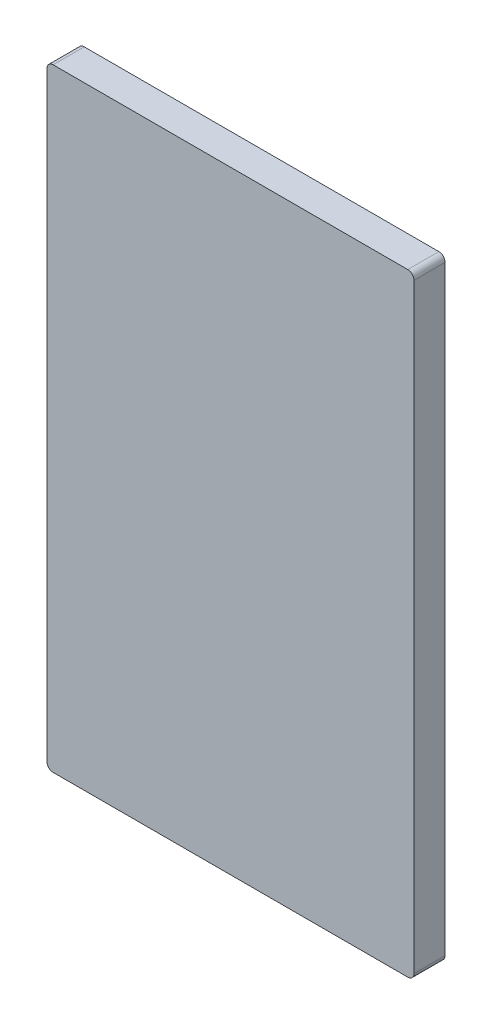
ISO-10303-21;
HEADER;
FILE_DESCRIPTION(('STEP AP214'),'2;1');
FILE_NAME('part.step','',(''),(''),'','','');
FILE_SCHEMA(('AUTOMOTIVE_DESIGN { 1 0 10303 214 1 1 1 1 }'));
ENDSEC;
DATA;
#1=APPLICATION_CONTEXT('core data for automotive mechanical design processes');
#2=APPLICATION_PROTOCOL_DEFINITION('international standard','automotive_design',2000,#1);
#3=PRODUCT_CONTEXT('',#1,'mechanical');
#4=PRODUCT('Part','Part','',(#3));
#5=PRODUCT_RELATED_PRODUCT_CATEGORY('part','',(#4));
#6=PRODUCT_DEFINITION_FORMATION('','',#4);
#7=PRODUCT_DEFINITION_CONTEXT('part definition',#1,'design');
#8=PRODUCT_DEFINITION('design','',#6,#7);
#9=PRODUCT_DEFINITION_SHAPE('','',#8);
#10=(LENGTH_UNIT() NAMED_UNIT(*) SI_UNIT(.MILLI.,.METRE.));
#11=(NAMED_UNIT(*) PLANE_ANGLE_UNIT() SI_UNIT($,.RADIAN.));
#12=(NAMED_UNIT(*) SI_UNIT($,.STERADIAN.) SOLID_ANGLE_UNIT());
#13=UNCERTAINTY_MEASURE_WITH_UNIT(LENGTH_MEASURE(1.E-05),#10,'distance_accuracy_value','');
#14=(GEOMETRIC_REPRESENTATION_CONTEXT(3) GLOBAL_UNCERTAINTY_ASSIGNED_CONTEXT((#13)) GLOBAL_UNIT_ASSIGNED_CONTEXT((#10,
#11,#12)) REPRESENTATION_CONTEXT('',''));
#15=CARTESIAN_POINT('',(0.,0.,0.));
#16=DIRECTION('',(0.,0.,1.));
#17=DIRECTION('',(1.,0.,0.));
#18=AXIS2_PLACEMENT_3D('',#15,#16,#17);
#19=CARTESIAN_POINT('',(-71.5649659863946,144.905555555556,10.));
#20=DIRECTION('',(0.,0.,-1.));
#21=DIRECTION('',(-1.,0.,0.));
#22=AXIS2_PLACEMENT_3D('',#19,#20,#21);
#23=CYLINDRICAL_SURFACE('',#22,2.);
#24=CARTESIAN_POINT('',(-71.5649659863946,144.905555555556,0.));
#25=DIRECTION('',(0.,0.,1.));
#26=DIRECTION('',(1.,0.,0.));
#27=AXIS2_PLACEMENT_3D('',#24,#25,#26);
#28=CIRCLE('',#27,2.);
#29=CARTESIAN_POINT('',(-71.5649659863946,146.905555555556,0.));
#30=VERTEX_POINT('',#29);
#31=CARTESIAN_POINT('',(-73.5649659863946,144.905555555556,0.));
#32=VERTEX_POINT('',#31);
#33=EDGE_CURVE('E128',#30,#32,#28,.T.);
#34=ORIENTED_EDGE('',*,*,#33,.T.);
#35=DIRECTION('',(0.,0.,-1.));
#36=VECTOR('',#35,1.);
#37=CARTESIAN_POINT('',(-73.5649659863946,144.905555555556,10.));
#38=LINE('',#37,#36);
#39=CARTESIAN_POINT('',(-73.5649659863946,144.905555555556,10.));
#40=VERTEX_POINT('',#39);
#41=EDGE_CURVE('E11',#40,#32,#38,.T.);
#42=ORIENTED_EDGE('',*,*,#41,.F.);
#43=CARTESIAN_POINT('',(-71.5649659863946,144.905555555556,10.));
#44=DIRECTION('',(0.,0.,1.));
#45=DIRECTION('',(1.,0.,0.));
#46=AXIS2_PLACEMENT_3D('',#43,#44,#45);
#47=CIRCLE('',#46,2.);
#48=CARTESIAN_POINT('',(-71.5649659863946,146.905555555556,10.));
#49=VERTEX_POINT('',#48);
#50=EDGE_CURVE('E142',#49,#40,#47,.T.);
#51=ORIENTED_EDGE('',*,*,#50,.F.);
#52=DIRECTION('',(0.,0.,-1.));
#53=VECTOR('',#52,1.);
#54=CARTESIAN_POINT('',(-71.5649659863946,146.905555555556,10.));
#55=LINE('',#54,#53);
#56=EDGE_CURVE('E124',#49,#30,#55,.T.);
#57=ORIENTED_EDGE('',*,*,#56,.T.);
#58=EDGE_LOOP('',(#34,#42,#51,#57));
#59=FACE_BOUND('',#58,.T.);
#60=ADVANCED_FACE('F32',(#59),#23,.T.);
#61=CARTESIAN_POINT('',(-73.5649659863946,144.905555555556,10.));
#62=DIRECTION('',(1.,0.,0.));
#63=DIRECTION('',(0.,1.,0.));
#64=AXIS2_PLACEMENT_3D('',#61,#62,#63);
#65=PLANE('',#64);
#66=DIRECTION('',(0.,-1.,0.));
#67=VECTOR('',#66,1.);
#68=CARTESIAN_POINT('',(-73.5649659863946,144.905555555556,0.));
#69=LINE('',#68,#67);
#70=CARTESIAN_POINT('',(-73.5649659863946,-48.0944444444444,0.));
#71=VERTEX_POINT('',#70);
#72=EDGE_CURVE('E131',#32,#71,#69,.T.);
#73=ORIENTED_EDGE('',*,*,#72,.T.);
#74=DIRECTION('',(0.,0.,-1.));
#75=VECTOR('',#74,1.);
#76=CARTESIAN_POINT('',(-73.5649659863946,-48.0944444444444,10.));
#77=LINE('',#76,#75);
#78=CARTESIAN_POINT('',(-73.5649659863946,-48.0944444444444,10.));
#79=VERTEX_POINT('',#78);
#80=EDGE_CURVE('E40',#79,#71,#77,.T.);
#81=ORIENTED_EDGE('',*,*,#80,.F.);
#82=DIRECTION('',(0.,-1.,0.));
#83=VECTOR('',#82,1.);
#84=CARTESIAN_POINT('',(-73.5649659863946,144.905555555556,10.));
#85=LINE('',#84,#83);
#86=EDGE_CURVE('E91',#40,#79,#85,.T.);
#87=ORIENTED_EDGE('',*,*,#86,.F.);
#88=ORIENTED_EDGE('',*,*,#41,.T.);
#89=EDGE_LOOP('',(#73,#81,#87,#88));
#90=FACE_BOUND('',#89,.T.);
#91=ADVANCED_FACE('F177',(#90),#65,.F.);
#92=CARTESIAN_POINT('',(-71.5649659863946,-48.0944444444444,10.));
#93=DIRECTION('',(0.,0.,-1.));
#94=DIRECTION('',(-1.,0.,0.));
#95=AXIS2_PLACEMENT_3D('',#92,#93,#94);
#96=CYLINDRICAL_SURFACE('',#95,2.);
#97=CARTESIAN_POINT('',(-71.5649659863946,-48.0944444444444,0.));
#98=DIRECTION('',(0.,0.,1.));
#99=DIRECTION('',(1.,0.,0.));
#100=AXIS2_PLACEMENT_3D('',#97,#98,#99);
#101=CIRCLE('',#100,2.);
#102=CARTESIAN_POINT('',(-71.5649659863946,-50.0944444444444,0.));
#103=VERTEX_POINT('',#102);
#104=EDGE_CURVE('E133',#71,#103,#101,.T.);
#105=ORIENTED_EDGE('',*,*,#104,.T.);
#106=DIRECTION('',(0.,0.,-1.));
#107=VECTOR('',#106,1.);
#108=CARTESIAN_POINT('',(-71.5649659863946,-50.0944444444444,10.));
#109=LINE('',#108,#107);
#110=CARTESIAN_POINT('',(-71.5649659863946,-50.0944444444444,10.));
#111=VERTEX_POINT('',#110);
#112=EDGE_CURVE('E149',#111,#103,#109,.T.);
#113=ORIENTED_EDGE('',*,*,#112,.F.);
#114=CARTESIAN_POINT('',(-71.5649659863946,-48.0944444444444,10.));
#115=DIRECTION('',(0.,0.,1.));
#116=DIRECTION('',(1.,0.,0.));
#117=AXIS2_PLACEMENT_3D('',#114,#115,#116);
#118=CIRCLE('',#117,2.);
#119=EDGE_CURVE('E157',#79,#111,#118,.T.);
#120=ORIENTED_EDGE('',*,*,#119,.F.);
#121=ORIENTED_EDGE('',*,*,#80,.T.);
#122=EDGE_LOOP('',(#105,#113,#120,#121));
#123=FACE_BOUND('',#122,.T.);
#124=ADVANCED_FACE('F155',(#123),#96,.T.);
#125=CARTESIAN_POINT('',(-71.5649659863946,-50.0944444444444,10.));
#126=DIRECTION('',(0.,1.,0.));
#127=DIRECTION('',(0.,0.,1.));
#128=AXIS2_PLACEMENT_3D('',#125,#126,#127);
#129=PLANE('',#128);
#130=DIRECTION('',(1.,0.,0.));
#131=VECTOR('',#130,1.);
#132=CARTESIAN_POINT('',(-71.5649659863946,-50.0944444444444,0.));
#133=LINE('',#132,#131);
#134=CARTESIAN_POINT('',(42.4350340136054,-50.0944444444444,0.));
#135=VERTEX_POINT('',#134);
#136=EDGE_CURVE('E135',#103,#135,#133,.T.);
#137=ORIENTED_EDGE('',*,*,#136,.T.);
#138=DIRECTION('',(0.,0.,-1.));
#139=VECTOR('',#138,1.);
#140=CARTESIAN_POINT('',(42.4350340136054,-50.0944444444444,10.));
#141=LINE('',#140,#139);
#142=CARTESIAN_POINT('',(42.4350340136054,-50.0944444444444,10.));
#143=VERTEX_POINT('',#142);
#144=EDGE_CURVE('E146',#143,#135,#141,.T.);
#145=ORIENTED_EDGE('',*,*,#144,.F.);
#146=DIRECTION('',(1.,0.,0.));
#147=VECTOR('',#146,1.);
#148=CARTESIAN_POINT('',(-71.5649659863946,-50.0944444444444,10.));
#149=LINE('',#148,#147);
#150=EDGE_CURVE('E169',#111,#143,#149,.T.);
#151=ORIENTED_EDGE('',*,*,#150,.F.);
#152=ORIENTED_EDGE('',*,*,#112,.T.);
#153=EDGE_LOOP('',(#137,#145,#151,#152));
#154=FACE_BOUND('',#153,.T.);
#155=ADVANCED_FACE('F165',(#154),#129,.F.);
#156=CARTESIAN_POINT('',(42.4350340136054,-48.0944444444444,10.));
#157=DIRECTION('',(0.,0.,-1.));
#158=DIRECTION('',(-1.,0.,0.));
#159=AXIS2_PLACEMENT_3D('',#156,#157,#158);
#160=CYLINDRICAL_SURFACE('',#159,1.99999999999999);
#161=CARTESIAN_POINT('',(42.4350340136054,-48.0944444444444,0.));
#162=DIRECTION('',(0.,0.,1.));
#163=DIRECTION('',(1.,0.,0.));
#164=AXIS2_PLACEMENT_3D('',#161,#162,#163);
#165=CIRCLE('',#164,1.99999999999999);
#166=CARTESIAN_POINT('',(44.4350340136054,-48.0944444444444,0.));
#167=VERTEX_POINT('',#166);
#168=EDGE_CURVE('E137',#135,#167,#165,.T.);
#169=ORIENTED_EDGE('',*,*,#168,.T.);
#170=DIRECTION('',(0.,0.,-1.));
#171=VECTOR('',#170,1.);
#172=CARTESIAN_POINT('',(44.4350340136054,-48.0944444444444,10.));
#173=LINE('',#172,#171);
#174=CARTESIAN_POINT('',(44.4350340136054,-48.0944444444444,10.));
#175=VERTEX_POINT('',#174);
#176=EDGE_CURVE('E119',#175,#167,#173,.T.);
#177=ORIENTED_EDGE('',*,*,#176,.F.);
#178=CARTESIAN_POINT('',(42.4350340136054,-48.0944444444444,10.));
#179=DIRECTION('',(0.,0.,1.));
#180=DIRECTION('',(1.,0.,0.));
#181=AXIS2_PLACEMENT_3D('',#178,#179,#180);
#182=CIRCLE('',#181,1.99999999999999);
#183=EDGE_CURVE('E110',#143,#175,#182,.T.);
#184=ORIENTED_EDGE('',*,*,#183,.F.);
#185=ORIENTED_EDGE('',*,*,#144,.T.);
#186=EDGE_LOOP('',(#169,#177,#184,#185));
#187=FACE_BOUND('',#186,.T.);
#188=ADVANCED_FACE('F168',(#187),#160,.T.);
#189=CARTESIAN_POINT('',(44.4350340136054,144.905555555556,10.));
#190=DIRECTION('',(-1.,0.,0.));
#191=DIRECTION('',(0.,-1.,0.));
#192=AXIS2_PLACEMENT_3D('',#189,#190,#191);
#193=PLANE('',#192);
#194=DIRECTION('',(0.,1.,0.));
#195=VECTOR('',#194,1.);
#196=CARTESIAN_POINT('',(44.4350340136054,144.905555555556,0.));
#197=LINE('',#196,#195);
#198=CARTESIAN_POINT('',(44.4350340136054,144.905555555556,0.));
#199=VERTEX_POINT('',#198);
#200=EDGE_CURVE('E118',#167,#199,#197,.T.);
#201=ORIENTED_EDGE('',*,*,#200,.T.);
#202=DIRECTION('',(0.,0.,-1.));
#203=VECTOR('',#202,1.);
#204=CARTESIAN_POINT('',(44.4350340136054,144.905555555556,10.));
#205=LINE('',#204,#203);
#206=CARTESIAN_POINT('',(44.4350340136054,144.905555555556,10.));
#207=VERTEX_POINT('',#206);
#208=EDGE_CURVE('E115',#207,#199,#205,.T.);
#209=ORIENTED_EDGE('',*,*,#208,.F.);
#210=DIRECTION('',(0.,1.,0.));
#211=VECTOR('',#210,1.);
#212=CARTESIAN_POINT('',(44.4350340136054,144.905555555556,10.));
#213=LINE('',#212,#211);
#214=EDGE_CURVE('E104',#175,#207,#213,.T.);
#215=ORIENTED_EDGE('',*,*,#214,.F.);
#216=ORIENTED_EDGE('',*,*,#176,.T.);
#217=EDGE_LOOP('',(#201,#209,#215,#216));
#218=FACE_BOUND('',#217,.T.);
#219=ADVANCED_FACE('F116',(#218),#193,.F.);
#220=CARTESIAN_POINT('',(42.4350340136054,144.905555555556,10.));
#221=DIRECTION('',(0.,0.,-1.));
#222=DIRECTION('',(-1.,0.,0.));
#223=AXIS2_PLACEMENT_3D('',#220,#221,#222);
#224=CYLINDRICAL_SURFACE('',#223,2.);
#225=CARTESIAN_POINT('',(42.4350340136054,144.905555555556,0.));
#226=DIRECTION('',(0.,0.,1.));
#227=DIRECTION('',(-1.,0.,0.));
#228=AXIS2_PLACEMENT_3D('',#225,#226,#227);
#229=CIRCLE('',#228,2.);
#230=CARTESIAN_POINT('',(42.4350340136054,146.905555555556,0.));
#231=VERTEX_POINT('',#230);
#232=EDGE_CURVE('E77',#199,#231,#229,.T.);
#233=ORIENTED_EDGE('',*,*,#232,.T.);
#234=DIRECTION('',(0.,0.,-1.));
#235=VECTOR('',#234,1.);
#236=CARTESIAN_POINT('',(42.4350340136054,146.905555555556,10.));
#237=LINE('',#236,#235);
#238=CARTESIAN_POINT('',(42.4350340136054,146.905555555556,10.));
#239=VERTEX_POINT('',#238);
#240=EDGE_CURVE('E120',#239,#231,#237,.T.);
#241=ORIENTED_EDGE('',*,*,#240,.F.);
#242=CARTESIAN_POINT('',(42.4350340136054,144.905555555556,10.));
#243=DIRECTION('',(0.,0.,1.));
#244=DIRECTION('',(-1.,0.,0.));
#245=AXIS2_PLACEMENT_3D('',#242,#243,#244);
#246=CIRCLE('',#245,2.);
#247=EDGE_CURVE('E108',#207,#239,#246,.T.);
#248=ORIENTED_EDGE('',*,*,#247,.F.);
#249=ORIENTED_EDGE('',*,*,#208,.T.);
#250=EDGE_LOOP('',(#233,#241,#248,#249));
#251=FACE_BOUND('',#250,.T.);
#252=ADVANCED_FACE('F122',(#251),#224,.T.);
#253=CARTESIAN_POINT('',(-71.5649659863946,146.905555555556,10.));
#254=DIRECTION('',(0.,-1.,0.));
#255=DIRECTION('',(0.,0.,-1.));
#256=AXIS2_PLACEMENT_3D('',#253,#254,#255);
#257=PLANE('',#256);
#258=DIRECTION('',(-1.,0.,0.));
#259=VECTOR('',#258,1.);
#260=CARTESIAN_POINT('',(-71.5649659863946,146.905555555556,0.));
#261=LINE('',#260,#259);
#262=EDGE_CURVE('E83',#231,#30,#261,.T.);
#263=ORIENTED_EDGE('',*,*,#262,.T.);
#264=ORIENTED_EDGE('',*,*,#56,.F.);
#265=DIRECTION('',(-1.,0.,0.));
#266=VECTOR('',#265,1.);
#267=CARTESIAN_POINT('',(-71.5649659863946,146.905555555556,10.));
#268=LINE('',#267,#266);
#269=EDGE_CURVE('E48',#239,#49,#268,.T.);
#270=ORIENTED_EDGE('',*,*,#269,.F.);
#271=ORIENTED_EDGE('',*,*,#240,.T.);
#272=EDGE_LOOP('',(#263,#264,#270,#271));
#273=FACE_BOUND('',#272,.T.);
#274=ADVANCED_FACE('F193',(#273),#257,.F.);
#275=CARTESIAN_POINT('',(-71.5649659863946,144.905555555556,10.));
#276=DIRECTION('',(0.,0.,1.));
#277=DIRECTION('',(1.,0.,0.));
#278=AXIS2_PLACEMENT_3D('',#275,#276,#277);
#279=PLANE('',#278);
#280=ORIENTED_EDGE('',*,*,#50,.T.);
#281=ORIENTED_EDGE('',*,*,#86,.T.);
#282=ORIENTED_EDGE('',*,*,#119,.T.);
#283=ORIENTED_EDGE('',*,*,#150,.T.);
#284=ORIENTED_EDGE('',*,*,#183,.T.);
#285=ORIENTED_EDGE('',*,*,#214,.T.);
#286=ORIENTED_EDGE('',*,*,#247,.T.);
#287=ORIENTED_EDGE('',*,*,#269,.T.);
#288=EDGE_LOOP('',(#280,#281,#282,#283,#284,#285,#286,#287));
#289=FACE_BOUND('',#288,.T.);
#290=ADVANCED_FACE('F106',(#289),#279,.T.);
#291=CARTESIAN_POINT('',(-71.5649659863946,144.905555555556,0.));
#292=DIRECTION('',(0.,0.,1.));
#293=DIRECTION('',(1.,0.,0.));
#294=AXIS2_PLACEMENT_3D('',#291,#292,#293);
#295=PLANE('',#294);
#296=ORIENTED_EDGE('',*,*,#33,.F.);
#297=ORIENTED_EDGE('',*,*,#262,.F.);
#298=ORIENTED_EDGE('',*,*,#232,.F.);
#299=ORIENTED_EDGE('',*,*,#200,.F.);
#300=ORIENTED_EDGE('',*,*,#168,.F.);
#301=ORIENTED_EDGE('',*,*,#136,.F.);
#302=ORIENTED_EDGE('',*,*,#104,.F.);
#303=ORIENTED_EDGE('',*,*,#72,.F.);
#304=EDGE_LOOP('',(#296,#297,#298,#299,#300,#301,#302,#303));
#305=FACE_BOUND('',#304,.T.);
#306=ADVANCED_FACE('F161',(#305),#295,.F.);
#307=CLOSED_SHELL('',(#60,#91,#124,#155,#188,#219,#252,#274,#290,#306));
#308=MANIFOLD_SOLID_BREP('B2',#307);
#309=ADVANCED_BREP_SHAPE_REPRESENTATION('',(#18,#308),#14);
#310=SHAPE_DEFINITION_REPRESENTATION(#9,#309);
ENDSEC;
END-ISO-10303-21;
